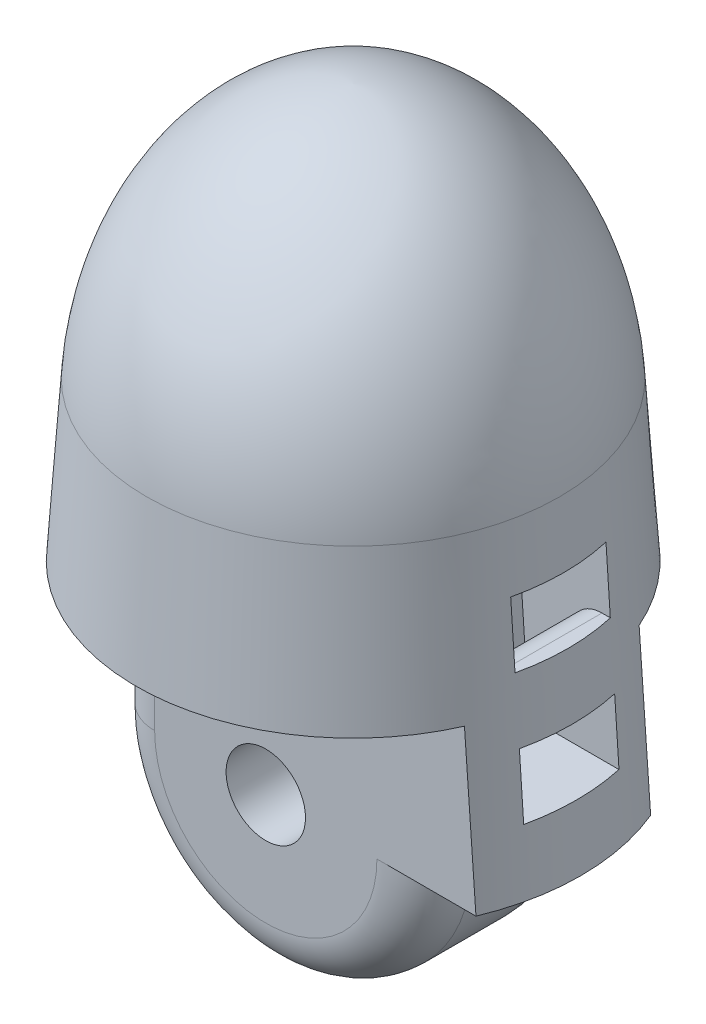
ISO-10303-21;
HEADER;
FILE_DESCRIPTION(('STEP AP214'),'2;1');
FILE_NAME('part.step','',(''),(''),'','','');
FILE_SCHEMA(('AUTOMOTIVE_DESIGN { 1 0 10303 214 1 1 1 1 }'));
ENDSEC;
DATA;
#1=APPLICATION_CONTEXT('core data for automotive mechanical design processes');
#2=APPLICATION_PROTOCOL_DEFINITION('international standard','automotive_design',2000,#1);
#3=PRODUCT_CONTEXT('',#1,'mechanical');
#4=PRODUCT('Part','Part','',(#3));
#5=PRODUCT_RELATED_PRODUCT_CATEGORY('part','',(#4));
#6=PRODUCT_DEFINITION_FORMATION('','',#4);
#7=PRODUCT_DEFINITION_CONTEXT('part definition',#1,'design');
#8=PRODUCT_DEFINITION('design','',#6,#7);
#9=PRODUCT_DEFINITION_SHAPE('','',#8);
#10=(LENGTH_UNIT() NAMED_UNIT(*) SI_UNIT(.MILLI.,.METRE.));
#11=(NAMED_UNIT(*) PLANE_ANGLE_UNIT() SI_UNIT($,.RADIAN.));
#12=(NAMED_UNIT(*) SI_UNIT($,.STERADIAN.) SOLID_ANGLE_UNIT());
#13=UNCERTAINTY_MEASURE_WITH_UNIT(LENGTH_MEASURE(1.E-05),#10,'distance_accuracy_value','');
#14=(GEOMETRIC_REPRESENTATION_CONTEXT(3) GLOBAL_UNCERTAINTY_ASSIGNED_CONTEXT((#13)) GLOBAL_UNIT_ASSIGNED_CONTEXT((#10,
#11,#12)) REPRESENTATION_CONTEXT('',''));
#15=CARTESIAN_POINT('',(0.,0.,0.));
#16=DIRECTION('',(0.,0.,1.));
#17=DIRECTION('',(1.,0.,0.));
#18=AXIS2_PLACEMENT_3D('',#15,#16,#17);
#19=CARTESIAN_POINT('',(0.,14.5666666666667,0.));
#20=DIRECTION('',(0.,0.,1.));
#21=DIRECTION('',(-0.0665190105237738,0.997785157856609,0.));
#22=AXIS2_PLACEMENT_3D('',#19,#20,#21);
#23=ELLIPSE('',#22,8.4520532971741,6.51442843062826);
#24=TRIMMED_CURVE('',#23,(PARAMETER_VALUE(3.05531167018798)),
(PARAMETER_VALUE(6.19690432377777)),.T.,.PARAMETER.);
#25=CARTESIAN_POINT('',(0.,0.,0.));
#26=DIRECTION('',(0.,-1.,0.));
#27=AXIS1_PLACEMENT('',#25,#26);
#28=SURFACE_OF_REVOLUTION('',#24,#27);
#29=CARTESIAN_POINT('',(0.,15.,0.));
#30=DIRECTION('',(0.,-1.,0.));
#31=DIRECTION('',(0.,0.,-1.));
#32=AXIS2_PLACEMENT_3D('',#29,#30,#31);
#33=CIRCLE('',#32,6.5);
#34=CARTESIAN_POINT('',(0.,15.,-6.5));
#35=VERTEX_POINT('',#34);
#36=EDGE_CURVE('E381',#35,#35,#33,.T.);
#37=ORIENTED_EDGE('',*,*,#36,.F.);
#38=EDGE_LOOP('',(#37));
#39=FACE_BOUND('',#38,.T.);
#40=CARTESIAN_POINT('',(0.,23.0059709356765,0.));
#41=VERTEX_POINT('',#40);
#42=VERTEX_LOOP('',#41);
#43=FACE_BOUND('',#42,.T.);
#44=CARTESIAN_POINT('',(-5.8,18.1335961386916,-0.399999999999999));
#45=CARTESIAN_POINT('',(-5.78266738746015,18.1782985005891,-0.399998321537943));
#46=CARTESIAN_POINT('',(-5.76508178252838,18.222900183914,-0.398877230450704));
#47=CARTESIAN_POINT('',(-5.7294619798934,18.3117874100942,-0.394141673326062));
#48=CARTESIAN_POINT('',(-5.7114278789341,18.3560730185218,-0.390527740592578));
#49=CARTESIAN_POINT('',(-5.67499263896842,18.4441682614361,-0.380435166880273));
#50=CARTESIAN_POINT('',(-5.65659155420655,18.4879779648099,-0.373956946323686));
#51=CARTESIAN_POINT('',(-5.6195704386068,18.574828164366,-0.357568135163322));
#52=CARTESIAN_POINT('',(-5.60095058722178,18.6178692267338,-0.347660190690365));
#53=CARTESIAN_POINT('',(-5.56362035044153,18.7029661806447,-0.323459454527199));
#54=CARTESIAN_POINT('',(-5.54490991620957,18.7450171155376,-0.309148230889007));
#55=CARTESIAN_POINT('',(-5.51728485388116,18.8063088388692,-0.283246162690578));
#56=CARTESIAN_POINT('',(-5.50817016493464,18.826398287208,-0.273899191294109));
#57=CARTESIAN_POINT('',(-5.49020702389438,18.8657505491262,-0.253405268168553));
#58=CARTESIAN_POINT('',(-5.48135851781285,18.8850135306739,-0.242258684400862));
#59=CARTESIAN_POINT('',(-5.46101671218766,18.9290437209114,-0.213329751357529));
#60=CARTESIAN_POINT('',(-5.44970578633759,18.9533235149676,-0.194598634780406));
#61=CARTESIAN_POINT('',(-5.43416062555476,18.9864834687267,-0.16218788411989));
#62=CARTESIAN_POINT('',(-5.42919357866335,18.9970400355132,-0.150593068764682));
#63=CARTESIAN_POINT('',(-5.42004926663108,19.0164216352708,-0.125746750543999));
#64=CARTESIAN_POINT('',(-5.41587013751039,19.0252507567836,-0.112499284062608));
#65=CARTESIAN_POINT('',(-5.40992440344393,19.0377873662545,-0.0890702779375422));
#66=CARTESIAN_POINT('',(-5.40781972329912,19.0422174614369,-0.0793647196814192));
#67=CARTESIAN_POINT('',(-5.40429085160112,19.0496384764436,-0.0593084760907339));
#68=CARTESIAN_POINT('',(-5.40286528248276,19.0526323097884,-0.0489591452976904));
#69=CARTESIAN_POINT('',(-5.40081905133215,19.0569278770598,-0.0277309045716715));
#70=CARTESIAN_POINT('',(-5.40020562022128,19.058214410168,-0.0168481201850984));
#71=CARTESIAN_POINT('',(-5.39988226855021,19.0588927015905,0.00499002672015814));
#72=CARTESIAN_POINT('',(-5.40017211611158,19.0582849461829,0.0159453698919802));
#73=CARTESIAN_POINT('',(-5.40154254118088,19.0554091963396,0.0364156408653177));
#74=CARTESIAN_POINT('',(-5.40253838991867,19.0533190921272,0.0459625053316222));
#75=CARTESIAN_POINT('',(-5.40513915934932,19.0478549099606,0.0646048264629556));
#76=CARTESIAN_POINT('',(-5.40674524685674,19.0444783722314,0.0736993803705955));
#77=CARTESIAN_POINT('',(-5.41138370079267,19.0347134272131,0.0957052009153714));
#78=CARTESIAN_POINT('',(-5.41472782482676,19.0276629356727,0.108255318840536));
#79=CARTESIAN_POINT('',(-5.42219424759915,19.0118790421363,0.131978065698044));
#80=CARTESIAN_POINT('',(-5.42631821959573,19.0031420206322,0.143147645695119));
#81=CARTESIAN_POINT('',(-5.43824244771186,18.9778014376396,0.171809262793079));
#82=CARTESIAN_POINT('',(-5.44655337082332,18.9600598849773,0.188070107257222));
#83=CARTESIAN_POINT('',(-5.46396741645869,18.9226571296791,0.217661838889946));
#84=CARTESIAN_POINT('',(-5.47307266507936,18.9029907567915,0.230984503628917));
#85=CARTESIAN_POINT('',(-5.49217206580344,18.861468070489,0.255930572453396));
#86=CARTESIAN_POINT('',(-5.50218789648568,18.8395513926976,0.267435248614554));
#87=CARTESIAN_POINT('',(-5.52246058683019,18.7948701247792,0.288416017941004));
#88=CARTESIAN_POINT('',(-5.53271765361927,18.7721047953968,0.297890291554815));
#89=CARTESIAN_POINT('',(-5.56366494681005,18.7028989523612,0.323846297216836));
#90=CARTESIAN_POINT('',(-5.5845093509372,18.6555960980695,0.337835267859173));
#91=CARTESIAN_POINT('',(-5.62896752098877,18.5530681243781,0.362600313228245));
#92=CARTESIAN_POINT('',(-5.65255702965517,18.497666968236,0.372644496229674));
#93=CARTESIAN_POINT('',(-5.6992197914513,18.3859321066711,0.387871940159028));
#94=CARTESIAN_POINT('',(-5.72229237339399,18.3295973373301,0.393049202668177));
#95=CARTESIAN_POINT('',(-5.76779026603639,18.2162152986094,0.399363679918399));
#96=CARTESIAN_POINT('',(-5.79021286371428,18.1591661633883,0.400485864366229));
#97=CARTESIAN_POINT('',(-5.83419151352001,18.0448349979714,0.399141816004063));
#98=CARTESIAN_POINT('',(-5.85574821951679,17.9875531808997,0.39667834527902));
#99=CARTESIAN_POINT('',(-5.90107833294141,17.8643433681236,0.387806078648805));
#100=CARTESIAN_POINT('',(-5.92470323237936,17.7983992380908,0.380863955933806));
#101=CARTESIAN_POINT('',(-5.97066575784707,17.666533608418,0.362612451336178));
#102=CARTESIAN_POINT('',(-5.99300127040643,17.6006123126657,0.351296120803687));
#103=CARTESIAN_POINT('',(-6.02540017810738,17.5021808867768,0.330691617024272));
#104=CARTESIAN_POINT('',(-6.03601004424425,17.4694639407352,0.323223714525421));
#105=CARTESIAN_POINT('',(-6.05684515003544,17.404248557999,0.306930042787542));
#106=CARTESIAN_POINT('',(-6.06707046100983,17.3717500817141,0.29810452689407));
#107=CARTESIAN_POINT('',(-6.08708110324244,17.3071722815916,0.278884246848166));
#108=CARTESIAN_POINT('',(-6.09686742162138,17.2750921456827,0.268493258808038));
#109=CARTESIAN_POINT('',(-6.11596679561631,17.2115039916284,0.245738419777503));
#110=CARTESIAN_POINT('',(-6.12528022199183,17.1799955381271,0.233376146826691));
#111=CARTESIAN_POINT('',(-6.13877196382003,17.1336376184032,0.212835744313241));
#112=CARTESIAN_POINT('',(-6.14317241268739,17.1183963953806,0.205689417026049));
#113=CARTESIAN_POINT('',(-6.15180359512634,17.0882703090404,0.190553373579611));
#114=CARTESIAN_POINT('',(-6.15603422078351,17.0733856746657,0.18256313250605));
#115=CARTESIAN_POINT('',(-6.1642399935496,17.0442958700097,0.165582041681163));
#116=CARTESIAN_POINT('',(-6.16821698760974,17.0300860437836,0.156600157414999));
#117=CARTESIAN_POINT('',(-6.17586846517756,17.0025491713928,0.137231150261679));
#118=CARTESIAN_POINT('',(-6.17954316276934,16.9892215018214,0.126845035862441));
#119=CARTESIAN_POINT('',(-6.18506030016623,16.9690814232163,0.108536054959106));
#120=CARTESIAN_POINT('',(-6.18705773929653,16.961757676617,0.101235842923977));
#121=CARTESIAN_POINT('',(-6.19078197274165,16.9480538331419,0.0857544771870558));
#122=CARTESIAN_POINT('',(-6.19250909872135,16.9416725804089,0.0775744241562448));
#123=CARTESIAN_POINT('',(-6.19612538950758,16.9282733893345,0.0568308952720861));
#124=CARTESIAN_POINT('',(-6.19783897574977,16.921890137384,0.0437640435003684));
#125=CARTESIAN_POINT('',(-6.19931017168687,16.9164027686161,0.0241885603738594));
#126=CARTESIAN_POINT('',(-6.19962566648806,16.9152245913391,0.0183018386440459));
#127=CARTESIAN_POINT('',(-6.19999268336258,16.913853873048,0.00640635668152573));
#128=CARTESIAN_POINT('',(-6.20004441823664,16.9136605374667,0.000397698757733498));
#129=CARTESIAN_POINT('',(-6.19987775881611,16.9142830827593,-0.0115561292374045));
#130=CARTESIAN_POINT('',(-6.19965959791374,16.915098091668,-0.0175013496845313));
#131=CARTESIAN_POINT('',(-6.19897704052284,16.9176455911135,-0.0291839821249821));
#132=CARTESIAN_POINT('',(-6.19851213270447,16.9193799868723,-0.0349209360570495));
#133=CARTESIAN_POINT('',(-6.19632747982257,16.9275176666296,-0.056389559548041));
#134=CARTESIAN_POINT('',(-6.19387646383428,16.9366260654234,-0.0710001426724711));
#135=CARTESIAN_POINT('',(-6.18839129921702,16.9568676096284,-0.0965038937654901));
#136=CARTESIAN_POINT('',(-6.18541264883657,16.9678048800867,-0.107590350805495));
#137=CARTESIAN_POINT('',(-6.17904932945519,16.9910119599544,-0.128201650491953));
#138=CARTESIAN_POINT('',(-6.17566337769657,17.0032859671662,-0.137721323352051));
#139=CARTESIAN_POINT('',(-6.16647968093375,17.0363404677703,-0.161043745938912));
#140=CARTESIAN_POINT('',(-6.16047678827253,17.0577196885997,-0.173890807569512));
#141=CARTESIAN_POINT('',(-6.14804831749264,17.1014606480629,-0.197582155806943));
#142=CARTESIAN_POINT('',(-6.14162185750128,17.123824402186,-0.208422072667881));
#143=CARTESIAN_POINT('',(-6.12841825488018,17.1692319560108,-0.228666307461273));
#144=CARTESIAN_POINT('',(-6.12163948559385,17.1922786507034,-0.238062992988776));
#145=CARTESIAN_POINT('',(-6.10782201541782,17.2387060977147,-0.255676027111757));
#146=CARTESIAN_POINT('',(-6.10078358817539,17.262086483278,-0.263893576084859));
#147=CARTESIAN_POINT('',(-6.08309380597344,17.3201714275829,-0.283018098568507));
#148=CARTESIAN_POINT('',(-6.07230369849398,17.3550175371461,-0.293366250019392));
#149=CARTESIAN_POINT('',(-6.05026159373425,17.4250235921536,-0.312377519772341));
#150=CARTESIAN_POINT('',(-6.03900946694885,17.4601836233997,-0.321040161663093));
#151=CARTESIAN_POINT('',(-6.00457589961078,17.5660478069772,-0.34486664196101));
#152=CARTESIAN_POINT('',(-5.9807461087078,17.6370412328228,-0.357839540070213));
#153=CARTESIAN_POINT('',(-5.93158432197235,17.7790614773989,-0.378672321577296));
#154=CARTESIAN_POINT('',(-5.9062555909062,17.8500879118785,-0.386542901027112));
#155=CARTESIAN_POINT('',(-5.85416208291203,17.9920254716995,-0.397208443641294));
#156=CARTESIAN_POINT('',(-5.82739709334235,18.0629365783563,-0.400002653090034));
#157=CARTESIAN_POINT('',(-5.8,18.1335961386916,-0.399999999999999));
#158=B_SPLINE_CURVE_WITH_KNOTS('',3,(#44,#45,#46,#47,#48,#49,#50,#51,#52,#53,#54,#55,#56,#57,
#58,#59,#60,#61,#62,#63,#64,#65,#66,#67,#68,#69,#70,#71,#72,#73,#74,#75,#76,#77,#78,#79,#80,#81,
#82,#83,#84,#85,#86,#87,#88,#89,#90,#91,#92,#93,#94,#95,#96,#97,#98,#99,#100,#101,#102,#103,
#104,#105,#106,#107,#108,#109,#110,#111,#112,#113,#114,#115,#116,#117,#118,#119,#120,#121,#122,
#123,#124,#125,#126,#127,#128,#129,#130,#131,#132,#133,#134,#135,#136,#137,#138,#139,#140,#141,
#142,#143,#144,#145,#146,#147,#148,#149,#150,#151,#152,#153,#154,#155,#156,#157),.UNSPECIFIED.,
.T.,.F.,(4,2,2,2,2,2,2,2,2,2,2,2,2,2,2,2,2,2,2,2,2,2,2,2,2,2,2,2,2,2,2,2,2,2,2,2,2,2,2,2,2,2,2,
2,2,2,2,2,2,2,2,2,2,2,2,2,4),(0.,0.143813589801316,0.287596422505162,0.431358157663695,
0.575009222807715,0.719269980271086,0.79107447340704,0.862864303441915,0.960260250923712,
1.0094761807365,1.05857417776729,1.0910868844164,1.12353335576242,1.15626681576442,
1.18899187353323,1.21833822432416,1.24774097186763,1.29182203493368,1.33599877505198,
1.41195129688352,1.48811374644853,1.56809582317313,1.64814927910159,1.80842983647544,
1.99132693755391,2.17444916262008,2.35824944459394,2.54190821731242,2.75294157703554,
2.96431156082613,3.06987678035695,3.17542232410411,3.28071723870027,3.38592828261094,
3.43810793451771,3.49032023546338,3.54209411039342,3.59383099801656,3.62535756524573,
3.65684514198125,3.69995739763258,3.71791498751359,3.73585808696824,3.753785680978,
3.77175057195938,3.82291302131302,3.87034778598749,3.91793605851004,3.9947217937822,
4.0716727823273,4.14901765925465,4.22628323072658,4.33997988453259,4.4537086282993,
4.68147534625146,4.90876303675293,5.13608447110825),.UNSPECIFIED.);
#159=CARTESIAN_POINT('',(-5.8,18.1335961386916,-0.399999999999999));
#160=VERTEX_POINT('',#159);
#161=EDGE_CURVE('E284',#160,#160,#158,.T.);
#162=ORIENTED_EDGE('',*,*,#161,.T.);
#163=EDGE_LOOP('',(#162));
#164=FACE_BOUND('',#163,.T.);
#165=ADVANCED_FACE('F153',(#39,#43,#164),#28,.F.);
#166=CARTESIAN_POINT('',(0.,0.,0.));
#167=DIRECTION('',(0.,-1.,0.));
#168=DIRECTION('',(0.,0.,-1.));
#169=AXIS2_PLACEMENT_3D('',#166,#167,#168);
#170=CONICAL_SURFACE('',#169,7.5,0.0665681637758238);
#171=CARTESIAN_POINT('',(5.98856100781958,19.8965758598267,1.5));
#172=CARTESIAN_POINT('',(6.12085283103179,17.9716111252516,1.5));
#173=CARTESIAN_POINT('',(6.2528943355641,16.046629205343,1.5));
#174=CARTESIAN_POINT('',(6.51655055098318,12.1966361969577,1.5));
#175=CARTESIAN_POINT('',(6.64816526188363,10.271625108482,1.5));
#176=CARTESIAN_POINT('',(6.87340841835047,6.97275039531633,1.5));
#177=CARTESIAN_POINT('',(6.96712345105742,5.59889268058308,1.5));
#178=CARTESIAN_POINT('',(7.15439314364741,2.85116628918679,1.5));
#179=CARTESIAN_POINT('',(7.2479478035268,1.47729761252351,1.5));
#180=CARTESIAN_POINT('',(7.34143197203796,0.103424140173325,1.5));
#181=B_SPLINE_CURVE_WITH_KNOTS('',3,(#171,#172,#173,#174,#175,#176,#177,#178,#179,#180),
.UNSPECIFIED.,.F.,.F.,(4,2,2,2,4),(0.,5.78851558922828,11.5770309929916,15.708181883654,
19.839332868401),.UNSPECIFIED.);
#182=CARTESIAN_POINT('',(6.46150997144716,13.,1.5));
#183=VERTEX_POINT('',#182);
#184=CARTESIAN_POINT('',(6.59831628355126,11.,1.5));
#185=VERTEX_POINT('',#184);
#186=EDGE_CURVE('E425',#183,#185,#181,.T.);
#187=ORIENTED_EDGE('',*,*,#186,.F.);
#188=CARTESIAN_POINT('',(0.,13.,0.));
#189=DIRECTION('',(0.,-1.,0.));
#190=DIRECTION('',(1.,0.,0.));
#191=AXIS2_PLACEMENT_3D('',#188,#189,#190);
#192=CIRCLE('',#191,6.63333333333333);
#193=CARTESIAN_POINT('',(6.46150997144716,13.,-1.5));
#194=VERTEX_POINT('',#193);
#195=EDGE_CURVE('E429',#183,#194,#192,.F.);
#196=ORIENTED_EDGE('',*,*,#195,.T.);
#197=CARTESIAN_POINT('',(5.98856100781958,19.8965758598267,-1.5));
#198=CARTESIAN_POINT('',(6.12085283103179,17.9716111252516,-1.5));
#199=CARTESIAN_POINT('',(6.2528943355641,16.046629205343,-1.5));
#200=CARTESIAN_POINT('',(6.51655055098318,12.1966361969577,-1.5));
#201=CARTESIAN_POINT('',(6.64816526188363,10.271625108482,-1.5));
#202=CARTESIAN_POINT('',(6.87340841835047,6.97275039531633,-1.5));
#203=CARTESIAN_POINT('',(6.96712345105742,5.59889268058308,-1.5));
#204=CARTESIAN_POINT('',(7.15439314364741,2.85116628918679,-1.5));
#205=CARTESIAN_POINT('',(7.2479478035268,1.47729761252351,-1.5));
#206=CARTESIAN_POINT('',(7.34143197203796,0.103424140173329,-1.5));
#207=B_SPLINE_CURVE_WITH_KNOTS('',3,(#197,#198,#199,#200,#201,#202,#203,#204,#205,#206),
.UNSPECIFIED.,.F.,.F.,(4,2,2,2,4),(0.,5.78851558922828,11.5770309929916,15.708181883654,
19.839332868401),.UNSPECIFIED.);
#208=CARTESIAN_POINT('',(6.59831628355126,11.,-1.5));
#209=VERTEX_POINT('',#208);
#210=EDGE_CURVE('E281',#194,#209,#207,.T.);
#211=ORIENTED_EDGE('',*,*,#210,.T.);
#212=CARTESIAN_POINT('',(0.,11.,0.));
#213=DIRECTION('',(0.,-1.,0.));
#214=DIRECTION('',(1.,0.,0.));
#215=AXIS2_PLACEMENT_3D('',#212,#213,#214);
#216=CIRCLE('',#215,6.76666666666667);
#217=EDGE_CURVE('E426',#185,#209,#216,.F.);
#218=ORIENTED_EDGE('',*,*,#217,.F.);
#219=EDGE_LOOP('',(#187,#196,#211,#218));
#220=FACE_BOUND('',#219,.T.);
#221=ORIENTED_EDGE('',*,*,#36,.T.);
#222=EDGE_LOOP('',(#221));
#223=FACE_BOUND('',#222,.T.);
#224=CARTESIAN_POINT('',(0.,10.,0.));
#225=DIRECTION('',(0.,-1.,0.));
#226=DIRECTION('',(0.,0.,-1.));
#227=AXIS2_PLACEMENT_3D('',#224,#225,#226);
#228=CIRCLE('',#227,6.83333333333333);
#229=CARTESIAN_POINT('',(6.2555530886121,10.,-2.75));
#230=VERTEX_POINT('',#229);
#231=CARTESIAN_POINT('',(6.2555530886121,10.,2.75));
#232=VERTEX_POINT('',#231);
#233=EDGE_CURVE('E384',#230,#232,#228,.F.);
#234=ORIENTED_EDGE('',*,*,#233,.T.);
#235=CARTESIAN_POINT('',(8.19804468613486,-17.2048505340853,2.75));
#236=CARTESIAN_POINT('',(8.00845466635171,-14.5089482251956,2.75));
#237=CARTESIAN_POINT('',(7.81824230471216,-11.8130894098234,2.75));
#238=CARTESIAN_POINT('',(7.43616495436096,-6.42149218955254,2.75));
#239=CARTESIAN_POINT('',(7.2442999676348,-3.72575378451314,2.75));
#240=CARTESIAN_POINT('',(6.88301247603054,1.32314550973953,2.75));
#241=CARTESIAN_POINT('',(6.71383515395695,3.67632392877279,2.75));
#242=CARTESIAN_POINT('',(6.37350874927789,8.38253784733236,2.75));
#243=CARTESIAN_POINT('',(6.20235966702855,10.7355733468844,2.75));
#244=CARTESIAN_POINT('',(5.85755001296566,15.4414656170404,2.75));
#245=CARTESIAN_POINT('',(5.68388943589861,17.7943223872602,2.75));
#246=CARTESIAN_POINT('',(5.42092621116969,21.3234241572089,2.75));
#247=CARTESIAN_POINT('',(5.33285971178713,22.4997612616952,2.75));
#248=CARTESIAN_POINT('',(5.15576221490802,24.8523630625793,2.75));
#249=CARTESIAN_POINT('',(5.06673121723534,26.0286277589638,2.75));
#250=CARTESIAN_POINT('',(4.97714778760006,27.2048505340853,2.75));
#251=B_SPLINE_CURVE_WITH_KNOTS('',3,(#235,#236,#237,#238,#239,#240,#241,#242,#243,#244,#245,
#246,#247,#248,#249,#250),.UNSPECIFIED.,.F.,.F.,(4,2,2,2,2,2,2,4),(0.,8.10768205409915,
16.2153543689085,23.2931094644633,30.3708632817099,37.4486319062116,40.9875186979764,
44.5264061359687),.UNSPECIFIED.);
#252=CARTESIAN_POINT('',(6.61805191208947,5.,2.75));
#253=VERTEX_POINT('',#252);
#254=EDGE_CURVE('E506',#253,#232,#251,.T.);
#255=ORIENTED_EDGE('',*,*,#254,.F.);
#256=CARTESIAN_POINT('',(0.,5.,0.));
#257=DIRECTION('',(0.,-1.,0.));
#258=DIRECTION('',(0.,0.,-1.));
#259=AXIS2_PLACEMENT_3D('',#256,#257,#258);
#260=CIRCLE('',#259,7.16666666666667);
#261=CARTESIAN_POINT('',(6.61805191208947,5.,-2.75));
#262=VERTEX_POINT('',#261);
#263=EDGE_CURVE('E388',#253,#262,#260,.F.);
#264=ORIENTED_EDGE('',*,*,#263,.T.);
#265=CARTESIAN_POINT('',(8.19804468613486,-17.2048505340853,-2.75));
#266=CARTESIAN_POINT('',(8.00845466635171,-14.5089482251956,-2.75));
#267=CARTESIAN_POINT('',(7.81824230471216,-11.8130894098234,-2.75));
#268=CARTESIAN_POINT('',(7.43616495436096,-6.42149218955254,-2.75));
#269=CARTESIAN_POINT('',(7.2442999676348,-3.72575378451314,-2.75));
#270=CARTESIAN_POINT('',(6.88301247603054,1.32314550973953,-2.75));
#271=CARTESIAN_POINT('',(6.71383515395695,3.67632392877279,-2.75));
#272=CARTESIAN_POINT('',(6.37350874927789,8.38253784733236,-2.75));
#273=CARTESIAN_POINT('',(6.20235966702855,10.7355733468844,-2.75));
#274=CARTESIAN_POINT('',(5.85755001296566,15.4414656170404,-2.75));
#275=CARTESIAN_POINT('',(5.68388943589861,17.7943223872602,-2.75));
#276=CARTESIAN_POINT('',(5.42092621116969,21.3234241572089,-2.75));
#277=CARTESIAN_POINT('',(5.33285971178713,22.4997612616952,-2.75));
#278=CARTESIAN_POINT('',(5.15576221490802,24.8523630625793,-2.75));
#279=CARTESIAN_POINT('',(5.06673121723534,26.0286277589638,-2.75));
#280=CARTESIAN_POINT('',(4.97714778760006,27.2048505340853,-2.75));
#281=B_SPLINE_CURVE_WITH_KNOTS('',3,(#265,#266,#267,#268,#269,#270,#271,#272,#273,#274,#275,
#276,#277,#278,#279,#280),.UNSPECIFIED.,.F.,.F.,(4,2,2,2,2,2,2,4),(0.,8.10768205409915,
16.2153543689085,23.2931094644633,30.3708632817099,37.4486319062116,40.9875186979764,
44.5264061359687),.UNSPECIFIED.);
#282=EDGE_CURVE('E328',#262,#230,#281,.T.);
#283=ORIENTED_EDGE('',*,*,#282,.T.);
#284=EDGE_LOOP('',(#234,#255,#264,#283));
#285=FACE_BOUND('',#284,.T.);
#286=CARTESIAN_POINT('',(6.73498329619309,9.,1.5));
#287=VERTEX_POINT('',#286);
#288=CARTESIAN_POINT('',(6.87151932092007,7.,1.5));
#289=VERTEX_POINT('',#288);
#290=EDGE_CURVE('E418',#287,#289,#181,.T.);
#291=ORIENTED_EDGE('',*,*,#290,.F.);
#292=CARTESIAN_POINT('',(0.,9.00000000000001,0.));
#293=DIRECTION('',(0.,-1.,0.));
#294=DIRECTION('',(1.,0.,0.));
#295=AXIS2_PLACEMENT_3D('',#292,#293,#294);
#296=CIRCLE('',#295,6.9);
#297=CARTESIAN_POINT('',(6.73498329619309,9.,-1.5));
#298=VERTEX_POINT('',#297);
#299=EDGE_CURVE('E403',#287,#298,#296,.F.);
#300=ORIENTED_EDGE('',*,*,#299,.T.);
#301=CARTESIAN_POINT('',(6.87151932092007,7.,-1.5));
#302=VERTEX_POINT('',#301);
#303=EDGE_CURVE('E391',#298,#302,#207,.T.);
#304=ORIENTED_EDGE('',*,*,#303,.T.);
#305=CARTESIAN_POINT('',(0.,7.,0.));
#306=DIRECTION('',(0.,-1.,0.));
#307=DIRECTION('',(1.,0.,0.));
#308=AXIS2_PLACEMENT_3D('',#305,#306,#307);
#309=CIRCLE('',#308,7.03333333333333);
#310=EDGE_CURVE('E424',#289,#302,#309,.F.);
#311=ORIENTED_EDGE('',*,*,#310,.F.);
#312=EDGE_LOOP('',(#291,#300,#304,#311));
#313=FACE_BOUND('',#312,.T.);
#314=ADVANCED_FACE('F340',(#220,#223,#285,#313),#170,.T.);
#315=CARTESIAN_POINT('',(0.,5.,-7.5));
#316=DIRECTION('',(0.,0.,1.));
#317=DIRECTION('',(1.,0.,0.));
#318=AXIS2_PLACEMENT_3D('',#315,#316,#317);
#319=CYLINDRICAL_SURFACE('',#318,5.);
#320=DIRECTION('',(0.,0.,1.));
#321=VECTOR('',#320,1.);
#322=CARTESIAN_POINT('',(5.,5.,-7.5));
#323=LINE('',#322,#321);
#324=CARTESIAN_POINT('',(5.,5.,-1.25));
#325=VERTEX_POINT('',#324);
#326=CARTESIAN_POINT('',(5.,5.,1.25));
#327=VERTEX_POINT('',#326);
#328=EDGE_CURVE('E514',#325,#327,#323,.T.);
#329=ORIENTED_EDGE('',*,*,#328,.T.);
#330=CARTESIAN_POINT('',(0.,5.,1.25));
#331=DIRECTION('',(0.,0.,-1.));
#332=DIRECTION('',(-1.,0.,0.));
#333=AXIS2_PLACEMENT_3D('',#330,#331,#332);
#334=CIRCLE('',#333,5.);
#335=CARTESIAN_POINT('',(-5.,5.,1.25));
#336=VERTEX_POINT('',#335);
#337=EDGE_CURVE('E452',#327,#336,#334,.T.);
#338=ORIENTED_EDGE('',*,*,#337,.T.);
#339=DIRECTION('',(0.,0.,1.));
#340=VECTOR('',#339,1.);
#341=CARTESIAN_POINT('',(-5.,5.,-7.5));
#342=LINE('',#341,#340);
#343=CARTESIAN_POINT('',(-5.,5.,-1.25));
#344=VERTEX_POINT('',#343);
#345=EDGE_CURVE('E379',#344,#336,#342,.T.);
#346=ORIENTED_EDGE('',*,*,#345,.F.);
#347=CARTESIAN_POINT('',(0.,5.,-1.25));
#348=DIRECTION('',(0.,0.,-1.));
#349=DIRECTION('',(-1.,0.,0.));
#350=AXIS2_PLACEMENT_3D('',#347,#348,#349);
#351=CIRCLE('',#350,5.);
#352=EDGE_CURVE('E450',#344,#325,#351,.F.);
#353=ORIENTED_EDGE('',*,*,#352,.T.);
#354=EDGE_LOOP('',(#329,#338,#346,#353));
#355=FACE_BOUND('',#354,.T.);
#356=ADVANCED_FACE('F368',(#355),#319,.T.);
#357=CARTESIAN_POINT('',(-5.,0.,-7.5));
#358=DIRECTION('',(-1.,0.,0.));
#359=DIRECTION('',(0.,0.,1.));
#360=AXIS2_PLACEMENT_3D('',#357,#358,#359);
#361=PLANE('',#360);
#362=ORIENTED_EDGE('',*,*,#345,.T.);
#363=DIRECTION('',(0.,-1.,0.));
#364=VECTOR('',#363,1.);
#365=CARTESIAN_POINT('',(-5.,10.,1.25));
#366=LINE('',#365,#364);
#367=CARTESIAN_POINT('',(-5.,10.,1.25));
#368=VERTEX_POINT('',#367);
#369=EDGE_CURVE('E444',#336,#368,#366,.F.);
#370=ORIENTED_EDGE('',*,*,#369,.T.);
#371=DIRECTION('',(0.,0.,1.));
#372=VECTOR('',#371,1.);
#373=CARTESIAN_POINT('',(-5.,10.,-7.5));
#374=LINE('',#373,#372);
#375=CARTESIAN_POINT('',(-5.,10.,-1.25));
#376=VERTEX_POINT('',#375);
#377=EDGE_CURVE('E385',#376,#368,#374,.T.);
#378=ORIENTED_EDGE('',*,*,#377,.F.);
#379=DIRECTION('',(0.,-1.,0.));
#380=VECTOR('',#379,1.);
#381=CARTESIAN_POINT('',(-5.,0.,-1.25));
#382=LINE('',#381,#380);
#383=EDGE_CURVE('E441',#376,#344,#382,.T.);
#384=ORIENTED_EDGE('',*,*,#383,.T.);
#385=EDGE_LOOP('',(#362,#370,#378,#384));
#386=FACE_BOUND('',#385,.T.);
#387=ADVANCED_FACE('F361',(#386),#361,.T.);
#388=CARTESIAN_POINT('',(0.,5.,-7.5));
#389=DIRECTION('',(0.,-1.,0.));
#390=DIRECTION('',(0.,0.,-1.));
#391=AXIS2_PLACEMENT_3D('',#388,#389,#390);
#392=PLANE('',#391);
#393=DIRECTION('',(1.,0.,0.));
#394=VECTOR('',#393,1.);
#395=CARTESIAN_POINT('',(0.,5.,2.75));
#396=LINE('',#395,#394);
#397=CARTESIAN_POINT('',(3.5,5.,2.75));
#398=VERTEX_POINT('',#397);
#399=EDGE_CURVE('E338',#398,#253,#396,.T.);
#400=ORIENTED_EDGE('',*,*,#399,.F.);
#401=CARTESIAN_POINT('',(3.5,5.,1.25));
#402=DIRECTION('',(0.,-1.,0.));
#403=DIRECTION('',(0.,0.,-1.));
#404=AXIS2_PLACEMENT_3D('',#401,#402,#403);
#405=CIRCLE('',#404,1.5);
#406=EDGE_CURVE('E458',#398,#327,#405,.F.);
#407=ORIENTED_EDGE('',*,*,#406,.T.);
#408=ORIENTED_EDGE('',*,*,#328,.F.);
#409=CARTESIAN_POINT('',(3.5,5.,-1.25));
#410=DIRECTION('',(0.,-1.,0.));
#411=DIRECTION('',(0.,0.,-1.));
#412=AXIS2_PLACEMENT_3D('',#409,#410,#411);
#413=CIRCLE('',#412,1.5);
#414=CARTESIAN_POINT('',(3.5,5.,-2.75));
#415=VERTEX_POINT('',#414);
#416=EDGE_CURVE('E460',#325,#415,#413,.F.);
#417=ORIENTED_EDGE('',*,*,#416,.T.);
#418=DIRECTION('',(1.,0.,0.));
#419=VECTOR('',#418,1.);
#420=CARTESIAN_POINT('',(0.,5.,-2.75));
#421=LINE('',#420,#419);
#422=EDGE_CURVE('E325',#415,#262,#421,.T.);
#423=ORIENTED_EDGE('',*,*,#422,.T.);
#424=ORIENTED_EDGE('',*,*,#263,.F.);
#425=EDGE_LOOP('',(#400,#407,#408,#417,#423,#424));
#426=FACE_BOUND('',#425,.T.);
#427=ADVANCED_FACE('F358',(#426),#392,.T.);
#428=CARTESIAN_POINT('',(0.,10.,-7.5));
#429=DIRECTION('',(0.,-1.,0.));
#430=DIRECTION('',(0.,0.,-1.));
#431=AXIS2_PLACEMENT_3D('',#428,#429,#430);
#432=PLANE('',#431);
#433=CARTESIAN_POINT('',(-5.8,10.,0.));
#434=DIRECTION('',(0.,-1.,0.));
#435=DIRECTION('',(0.,0.,-1.));
#436=AXIS2_PLACEMENT_3D('',#433,#434,#435);
#437=CIRCLE('',#436,0.4);
#438=CARTESIAN_POINT('',(-5.8,10.,-0.4));
#439=VERTEX_POINT('',#438);
#440=EDGE_CURVE('E431',#439,#439,#437,.F.);
#441=ORIENTED_EDGE('',*,*,#440,.T.);
#442=EDGE_LOOP('',(#441));
#443=FACE_BOUND('',#442,.T.);
#444=DIRECTION('',(1.,0.,0.));
#445=VECTOR('',#444,1.);
#446=CARTESIAN_POINT('',(-6.83333333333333,10.,-2.75));
#447=LINE('',#446,#445);
#448=CARTESIAN_POINT('',(-3.5,10.,-2.75));
#449=VERTEX_POINT('',#448);
#450=EDGE_CURVE('E294',#449,#230,#447,.T.);
#451=ORIENTED_EDGE('',*,*,#450,.F.);
#452=CARTESIAN_POINT('',(-3.5,10.,-1.25));
#453=DIRECTION('',(0.,-1.,0.));
#454=DIRECTION('',(0.,0.,-1.));
#455=AXIS2_PLACEMENT_3D('',#452,#453,#454);
#456=CIRCLE('',#455,1.5);
#457=EDGE_CURVE('E456',#449,#376,#456,.F.);
#458=ORIENTED_EDGE('',*,*,#457,.T.);
#459=ORIENTED_EDGE('',*,*,#377,.T.);
#460=CARTESIAN_POINT('',(-3.5,10.,1.25));
#461=DIRECTION('',(0.,-1.,0.));
#462=DIRECTION('',(0.,0.,-1.));
#463=AXIS2_PLACEMENT_3D('',#460,#461,#462);
#464=CIRCLE('',#463,1.5);
#465=CARTESIAN_POINT('',(-3.5,10.,2.75));
#466=VERTEX_POINT('',#465);
#467=EDGE_CURVE('E454',#368,#466,#464,.F.);
#468=ORIENTED_EDGE('',*,*,#467,.T.);
#469=DIRECTION('',(1.,0.,0.));
#470=VECTOR('',#469,1.);
#471=CARTESIAN_POINT('',(-6.83333333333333,10.,2.75));
#472=LINE('',#471,#470);
#473=EDGE_CURVE('E321',#466,#232,#472,.T.);
#474=ORIENTED_EDGE('',*,*,#473,.T.);
#475=ORIENTED_EDGE('',*,*,#233,.F.);
#476=EDGE_LOOP('',(#451,#458,#459,#468,#474,#475));
#477=FACE_BOUND('',#476,.T.);
#478=ADVANCED_FACE('F350',(#443,#477),#432,.T.);
#479=CARTESIAN_POINT('',(-6.83333333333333,0.,-2.75));
#480=DIRECTION('',(0.,0.,-1.));
#481=DIRECTION('',(-1.,0.,0.));
#482=AXIS2_PLACEMENT_3D('',#479,#480,#481);
#483=PLANE('',#482);
#484=CARTESIAN_POINT('',(0.,5.,-2.75));
#485=DIRECTION('',(0.,0.,-1.));
#486=DIRECTION('',(-1.,0.,0.));
#487=AXIS2_PLACEMENT_3D('',#484,#485,#486);
#488=CIRCLE('',#487,3.5);
#489=CARTESIAN_POINT('',(-3.5,5.,-2.75));
#490=VERTEX_POINT('',#489);
#491=EDGE_CURVE('E446',#415,#490,#488,.T.);
#492=ORIENTED_EDGE('',*,*,#491,.T.);
#493=DIRECTION('',(0.,-1.,0.));
#494=VECTOR('',#493,1.);
#495=CARTESIAN_POINT('',(-3.5,0.,-2.75));
#496=LINE('',#495,#494);
#497=EDGE_CURVE('E448',#490,#449,#496,.F.);
#498=ORIENTED_EDGE('',*,*,#497,.T.);
#499=ORIENTED_EDGE('',*,*,#450,.T.);
#500=ORIENTED_EDGE('',*,*,#282,.F.);
#501=ORIENTED_EDGE('',*,*,#422,.F.);
#502=EDGE_LOOP('',(#492,#498,#499,#500,#501));
#503=FACE_BOUND('',#502,.T.);
#504=CARTESIAN_POINT('',(0.,5.,-2.75));
#505=DIRECTION('',(0.,0.,-1.));
#506=DIRECTION('',(-1.,0.,0.));
#507=AXIS2_PLACEMENT_3D('',#504,#505,#506);
#508=CIRCLE('',#507,1.25);
#509=CARTESIAN_POINT('',(1.25,5.,-2.75));
#510=VERTEX_POINT('',#509);
#511=EDGE_CURVE('E323',#510,#510,#508,.F.);
#512=ORIENTED_EDGE('',*,*,#511,.T.);
#513=EDGE_LOOP('',(#512));
#514=FACE_BOUND('',#513,.T.);
#515=ADVANCED_FACE('F344',(#503,#514),#483,.T.);
#516=CARTESIAN_POINT('',(-6.83333333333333,0.,2.75));
#517=DIRECTION('',(0.,0.,-1.));
#518=DIRECTION('',(-1.,0.,0.));
#519=AXIS2_PLACEMENT_3D('',#516,#517,#518);
#520=PLANE('',#519);
#521=ORIENTED_EDGE('',*,*,#473,.F.);
#522=DIRECTION('',(0.,-1.,0.));
#523=VECTOR('',#522,1.);
#524=CARTESIAN_POINT('',(-3.5,5.,2.75));
#525=LINE('',#524,#523);
#526=CARTESIAN_POINT('',(-3.5,5.,2.75));
#527=VERTEX_POINT('',#526);
#528=EDGE_CURVE('E438',#466,#527,#525,.T.);
#529=ORIENTED_EDGE('',*,*,#528,.T.);
#530=CARTESIAN_POINT('',(0.,5.,2.75));
#531=DIRECTION('',(0.,0.,-1.));
#532=DIRECTION('',(-1.,0.,0.));
#533=AXIS2_PLACEMENT_3D('',#530,#531,#532);
#534=CIRCLE('',#533,3.5);
#535=EDGE_CURVE('E435',#527,#398,#534,.F.);
#536=ORIENTED_EDGE('',*,*,#535,.T.);
#537=ORIENTED_EDGE('',*,*,#399,.T.);
#538=ORIENTED_EDGE('',*,*,#254,.T.);
#539=EDGE_LOOP('',(#521,#529,#536,#537,#538));
#540=FACE_BOUND('',#539,.T.);
#541=CARTESIAN_POINT('',(0.,5.,2.75));
#542=DIRECTION('',(0.,0.,-1.));
#543=DIRECTION('',(-1.,0.,0.));
#544=AXIS2_PLACEMENT_3D('',#541,#542,#543);
#545=CIRCLE('',#544,1.25);
#546=CARTESIAN_POINT('',(1.25,5.,2.75));
#547=VERTEX_POINT('',#546);
#548=EDGE_CURVE('E337',#547,#547,#545,.F.);
#549=ORIENTED_EDGE('',*,*,#548,.F.);
#550=EDGE_LOOP('',(#549));
#551=FACE_BOUND('',#550,.T.);
#552=ADVANCED_FACE('F349',(#540,#551),#520,.F.);
#553=CARTESIAN_POINT('',(0.,5.,-7.5));
#554=DIRECTION('',(0.,0.,1.));
#555=DIRECTION('',(1.,0.,0.));
#556=AXIS2_PLACEMENT_3D('',#553,#554,#555);
#557=CYLINDRICAL_SURFACE('',#556,1.25);
#558=CARTESIAN_POINT('',(1.25,5.,2.75));
#559=CARTESIAN_POINT('',(1.25,5.,2.69270833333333));
#560=CARTESIAN_POINT('',(1.25,5.,2.63541666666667));
#561=CARTESIAN_POINT('',(1.25,5.,2.52083333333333));
#562=CARTESIAN_POINT('',(1.25,5.,2.46354166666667));
#563=CARTESIAN_POINT('',(1.25,5.,2.34895833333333));
#564=CARTESIAN_POINT('',(1.25,5.,2.29166666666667));
#565=CARTESIAN_POINT('',(1.25,5.,2.17708333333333));
#566=CARTESIAN_POINT('',(1.25,5.,2.11979166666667));
#567=CARTESIAN_POINT('',(1.25,5.,2.00520833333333));
#568=CARTESIAN_POINT('',(1.25,5.,1.94791666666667));
#569=CARTESIAN_POINT('',(1.25,5.,1.83333333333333));
#570=CARTESIAN_POINT('',(1.25,5.,1.77604166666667));
#571=CARTESIAN_POINT('',(1.25,5.,1.66145833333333));
#572=CARTESIAN_POINT('',(1.25,5.,1.60416666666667));
#573=CARTESIAN_POINT('',(1.25,5.,1.48958333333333));
#574=CARTESIAN_POINT('',(1.25,5.,1.43229166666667));
#575=CARTESIAN_POINT('',(1.25,5.,1.31770833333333));
#576=CARTESIAN_POINT('',(1.25,5.,1.26041666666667));
#577=CARTESIAN_POINT('',(1.25,5.,1.14583333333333));
#578=CARTESIAN_POINT('',(1.25,5.,1.08854166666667));
#579=CARTESIAN_POINT('',(1.25,5.,0.973958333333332));
#580=CARTESIAN_POINT('',(1.25,5.,0.916666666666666));
#581=CARTESIAN_POINT('',(1.25,5.,0.802083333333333));
#582=CARTESIAN_POINT('',(1.25,5.,0.744791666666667));
#583=CARTESIAN_POINT('',(1.25,5.,0.630208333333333));
#584=CARTESIAN_POINT('',(1.25,5.,0.572916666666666));
#585=CARTESIAN_POINT('',(1.25,5.,0.458333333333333));
#586=CARTESIAN_POINT('',(1.25,5.,0.401041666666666));
#587=CARTESIAN_POINT('',(1.25,5.,0.286458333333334));
#588=CARTESIAN_POINT('',(1.25,5.,0.229166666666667));
#589=CARTESIAN_POINT('',(1.25,5.,0.114583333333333));
#590=CARTESIAN_POINT('',(1.25,5.,0.0572916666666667));
#591=CARTESIAN_POINT('',(1.25,5.,-0.0572916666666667));
#592=CARTESIAN_POINT('',(1.25,5.,-0.114583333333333));
#593=CARTESIAN_POINT('',(1.25,5.,-0.229166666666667));
#594=CARTESIAN_POINT('',(1.25,5.,-0.286458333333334));
#595=CARTESIAN_POINT('',(1.25,5.,-0.401041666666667));
#596=CARTESIAN_POINT('',(1.25,5.,-0.458333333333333));
#597=CARTESIAN_POINT('',(1.25,5.,-0.572916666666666));
#598=CARTESIAN_POINT('',(1.25,5.,-0.630208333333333));
#599=CARTESIAN_POINT('',(1.25,5.,-0.744791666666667));
#600=CARTESIAN_POINT('',(1.25,5.,-0.802083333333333));
#601=CARTESIAN_POINT('',(1.25,5.,-0.916666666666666));
#602=CARTESIAN_POINT('',(1.25,5.,-0.973958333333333));
#603=CARTESIAN_POINT('',(1.25,5.,-1.08854166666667));
#604=CARTESIAN_POINT('',(1.25,5.,-1.14583333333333));
#605=CARTESIAN_POINT('',(1.25,5.,-1.26041666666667));
#606=CARTESIAN_POINT('',(1.25,5.,-1.31770833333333));
#607=CARTESIAN_POINT('',(1.25,5.,-1.43229166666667));
#608=CARTESIAN_POINT('',(1.25,5.,-1.48958333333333));
#609=CARTESIAN_POINT('',(1.25,5.,-1.60416666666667));
#610=CARTESIAN_POINT('',(1.25,5.,-1.66145833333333));
#611=CARTESIAN_POINT('',(1.25,5.,-1.77604166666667));
#612=CARTESIAN_POINT('',(1.25,5.,-1.83333333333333));
#613=CARTESIAN_POINT('',(1.25,5.,-1.94791666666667));
#614=CARTESIAN_POINT('',(1.25,5.,-2.00520833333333));
#615=CARTESIAN_POINT('',(1.25,5.,-2.11979166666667));
#616=CARTESIAN_POINT('',(1.25,5.,-2.17708333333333));
#617=CARTESIAN_POINT('',(1.25,5.,-2.29166666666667));
#618=CARTESIAN_POINT('',(1.25,5.,-2.34895833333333));
#619=CARTESIAN_POINT('',(1.25,5.,-2.46354166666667));
#620=CARTESIAN_POINT('',(1.25,5.,-2.52083333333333));
#621=CARTESIAN_POINT('',(1.25,5.,-2.63541666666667));
#622=CARTESIAN_POINT('',(1.25,5.,-2.69270833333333));
#623=CARTESIAN_POINT('',(1.25,5.,-2.75));
#624=B_SPLINE_CURVE_WITH_KNOTS('',3,(#558,#559,#560,#561,#562,#563,#564,#565,#566,#567,#568,
#569,#570,#571,#572,#573,#574,#575,#576,#577,#578,#579,#580,#581,#582,#583,#584,#585,#586,#587,
#588,#589,#590,#591,#592,#593,#594,#595,#596,#597,#598,#599,#600,#601,#602,#603,#604,#605,#606,
#607,#608,#609,#610,#611,#612,#613,#614,#615,#616,#617,#618,#619,#620,#621,#622,#623),
.UNSPECIFIED.,.F.,.F.,(4,2,2,2,2,2,2,2,2,2,2,2,2,2,2,2,2,2,2,2,2,2,2,2,2,2,2,2,2,2,2,2,4),(0.,
0.171875,0.34375,0.515625,0.687500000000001,0.859374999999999,1.03125,1.203125,1.375,1.546875,
1.71875,1.890625,2.0625,2.234375,2.40625,2.578125,2.75,2.921875,3.09375,3.265625,3.4375,
3.609375,3.78125,3.953125,4.125,4.296875,4.46875,4.640625,4.8125,4.984375,5.15625,5.328125,5.5),.UNSPECIFIED.);
#625=EDGE_CURVE('BSEAM354',#547,#510,#624,.T.);
#626=ORIENTED_EDGE('',*,*,#548,.T.);
#627=ORIENTED_EDGE('',*,*,#511,.F.);
#628=ORIENTED_EDGE('',*,*,#625,.T.);
#629=ORIENTED_EDGE('',*,*,#625,.F.);
#630=EDGE_LOOP('',(#626,#628,#627,#629));
#631=FACE_BOUND('',#630,.T.);
#632=ADVANCED_FACE('F354',(#631),#557,.F.);
#633=CARTESIAN_POINT('',(0.,13.,1.5));
#634=DIRECTION('',(0.,-1.,0.));
#635=DIRECTION('',(1.,0.,0.));
#636=AXIS2_PLACEMENT_3D('',#633,#634,#635);
#637=PLANE('',#636);
#638=ORIENTED_EDGE('',*,*,#195,.F.);
#639=DIRECTION('',(-1.,0.,0.));
#640=VECTOR('',#639,1.);
#641=CARTESIAN_POINT('',(0.,13.,1.5));
#642=LINE('',#641,#640);
#643=CARTESIAN_POINT('',(3.63333333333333,13.,1.5));
#644=VERTEX_POINT('',#643);
#645=EDGE_CURVE('E290',#183,#644,#642,.T.);
#646=ORIENTED_EDGE('',*,*,#645,.T.);
#647=DIRECTION('',(0.,0.,-1.));
#648=VECTOR('',#647,1.);
#649=CARTESIAN_POINT('',(3.63333333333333,13.,1.5));
#650=LINE('',#649,#648);
#651=CARTESIAN_POINT('',(3.63333333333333,13.,-1.5));
#652=VERTEX_POINT('',#651);
#653=EDGE_CURVE('E287',#644,#652,#650,.T.);
#654=ORIENTED_EDGE('',*,*,#653,.T.);
#655=DIRECTION('',(-1.,0.,0.));
#656=VECTOR('',#655,1.);
#657=CARTESIAN_POINT('',(0.,13.,-1.5));
#658=LINE('',#657,#656);
#659=EDGE_CURVE('E274',#194,#652,#658,.T.);
#660=ORIENTED_EDGE('',*,*,#659,.F.);
#661=EDGE_LOOP('',(#638,#646,#654,#660));
#662=FACE_BOUND('',#661,.T.);
#663=ADVANCED_FACE('F288',(#662),#637,.T.);
#664=CARTESIAN_POINT('',(4.48008849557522,0.298672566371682,1.5));
#665=DIRECTION('',(-0.997785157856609,-0.0665190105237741,0.));
#666=DIRECTION('',(0.0665190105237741,-0.997785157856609,0.));
#667=AXIS2_PLACEMENT_3D('',#664,#665,#666);
#668=PLANE('',#667);
#669=ORIENTED_EDGE('',*,*,#653,.F.);
#670=DIRECTION('',(-0.0665190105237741,0.997785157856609,0.));
#671=VECTOR('',#670,1.);
#672=CARTESIAN_POINT('',(4.48008849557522,0.298672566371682,1.5));
#673=LINE('',#672,#671);
#674=CARTESIAN_POINT('',(4.03333333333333,7.,1.5));
#675=VERTEX_POINT('',#674);
#676=EDGE_CURVE('E311',#675,#644,#673,.T.);
#677=ORIENTED_EDGE('',*,*,#676,.F.);
#678=DIRECTION('',(0.,0.,-1.));
#679=VECTOR('',#678,1.);
#680=CARTESIAN_POINT('',(4.03333333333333,7.,1.5));
#681=LINE('',#680,#679);
#682=CARTESIAN_POINT('',(4.03333333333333,7.,-1.5));
#683=VERTEX_POINT('',#682);
#684=EDGE_CURVE('E295',#675,#683,#681,.T.);
#685=ORIENTED_EDGE('',*,*,#684,.T.);
#686=DIRECTION('',(-0.0665190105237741,0.997785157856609,0.));
#687=VECTOR('',#686,1.);
#688=CARTESIAN_POINT('',(4.48008849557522,0.298672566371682,-1.5));
#689=LINE('',#688,#687);
#690=EDGE_CURVE('E279',#683,#652,#689,.T.);
#691=ORIENTED_EDGE('',*,*,#690,.T.);
#692=EDGE_LOOP('',(#669,#677,#685,#691));
#693=FACE_BOUND('',#692,.T.);
#694=ADVANCED_FACE('F298',(#693),#668,.F.);
#695=CARTESIAN_POINT('',(0.,7.,1.5));
#696=DIRECTION('',(0.,-1.,0.));
#697=DIRECTION('',(1.,0.,0.));
#698=AXIS2_PLACEMENT_3D('',#695,#696,#697);
#699=PLANE('',#698);
#700=ORIENTED_EDGE('',*,*,#310,.T.);
#701=DIRECTION('',(-1.,0.,0.));
#702=VECTOR('',#701,1.);
#703=CARTESIAN_POINT('',(0.,7.,-1.5));
#704=LINE('',#703,#702);
#705=EDGE_CURVE('E300',#302,#683,#704,.T.);
#706=ORIENTED_EDGE('',*,*,#705,.T.);
#707=ORIENTED_EDGE('',*,*,#684,.F.);
#708=DIRECTION('',(-1.,0.,0.));
#709=VECTOR('',#708,1.);
#710=CARTESIAN_POINT('',(0.,7.,1.5));
#711=LINE('',#710,#709);
#712=EDGE_CURVE('E313',#289,#675,#711,.T.);
#713=ORIENTED_EDGE('',*,*,#712,.F.);
#714=EDGE_LOOP('',(#700,#706,#707,#713));
#715=FACE_BOUND('',#714,.T.);
#716=ADVANCED_FACE('F494',(#715),#699,.F.);
#717=CARTESIAN_POINT('',(0.,9.00000000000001,1.5));
#718=DIRECTION('',(0.,-1.,0.));
#719=DIRECTION('',(1.,0.,0.));
#720=AXIS2_PLACEMENT_3D('',#717,#718,#719);
#721=PLANE('',#720);
#722=DIRECTION('',(-1.,0.,0.));
#723=VECTOR('',#722,1.);
#724=CARTESIAN_POINT('',(0.,9.00000000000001,1.5));
#725=LINE('',#724,#723);
#726=CARTESIAN_POINT('',(6.33555309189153,9.,1.5));
#727=VERTEX_POINT('',#726);
#728=EDGE_CURVE('E315',#287,#727,#725,.T.);
#729=ORIENTED_EDGE('',*,*,#728,.T.);
#730=DIRECTION('',(0.,0.,-1.));
#731=VECTOR('',#730,1.);
#732=CARTESIAN_POINT('',(6.33555309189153,9.,-1.5));
#733=LINE('',#732,#731);
#734=CARTESIAN_POINT('',(6.33555309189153,9.,-1.5));
#735=VERTEX_POINT('',#734);
#736=EDGE_CURVE('E463',#727,#735,#733,.T.);
#737=ORIENTED_EDGE('',*,*,#736,.T.);
#738=DIRECTION('',(-1.,0.,0.));
#739=VECTOR('',#738,1.);
#740=CARTESIAN_POINT('',(0.,9.00000000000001,-1.5));
#741=LINE('',#740,#739);
#742=EDGE_CURVE('E302',#298,#735,#741,.T.);
#743=ORIENTED_EDGE('',*,*,#742,.F.);
#744=ORIENTED_EDGE('',*,*,#299,.F.);
#745=EDGE_LOOP('',(#729,#737,#743,#744));
#746=FACE_BOUND('',#745,.T.);
#747=ADVANCED_FACE('F487',(#746),#721,.T.);
#748=CARTESIAN_POINT('',(0.,11.,1.5));
#749=DIRECTION('',(0.,-1.,0.));
#750=DIRECTION('',(1.,0.,0.));
#751=AXIS2_PLACEMENT_3D('',#748,#749,#750);
#752=PLANE('',#751);
#753=DIRECTION('',(-1.,0.,0.));
#754=VECTOR('',#753,1.);
#755=CARTESIAN_POINT('',(0.,11.,-1.5));
#756=LINE('',#755,#754);
#757=CARTESIAN_POINT('',(6.33555309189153,11.,-1.5));
#758=VERTEX_POINT('',#757);
#759=EDGE_CURVE('E307',#209,#758,#756,.T.);
#760=ORIENTED_EDGE('',*,*,#759,.T.);
#761=DIRECTION('',(0.,0.,-1.));
#762=VECTOR('',#761,1.);
#763=CARTESIAN_POINT('',(6.33555309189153,11.,1.5));
#764=LINE('',#763,#762);
#765=CARTESIAN_POINT('',(6.33555309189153,11.,1.5));
#766=VERTEX_POINT('',#765);
#767=EDGE_CURVE('E469',#758,#766,#764,.F.);
#768=ORIENTED_EDGE('',*,*,#767,.T.);
#769=DIRECTION('',(-1.,0.,0.));
#770=VECTOR('',#769,1.);
#771=CARTESIAN_POINT('',(0.,11.,1.5));
#772=LINE('',#771,#770);
#773=EDGE_CURVE('E318',#185,#766,#772,.T.);
#774=ORIENTED_EDGE('',*,*,#773,.F.);
#775=ORIENTED_EDGE('',*,*,#217,.T.);
#776=EDGE_LOOP('',(#760,#768,#774,#775));
#777=FACE_BOUND('',#776,.T.);
#778=ADVANCED_FACE('F415',(#777),#752,.F.);
#779=CARTESIAN_POINT('',(0.,0.,1.5));
#780=DIRECTION('',(0.,0.,1.));
#781=DIRECTION('',(1.,0.,0.));
#782=AXIS2_PLACEMENT_3D('',#779,#780,#781);
#783=PLANE('',#782);
#784=ORIENTED_EDGE('',*,*,#186,.T.);
#785=ORIENTED_EDGE('',*,*,#773,.T.);
#786=CARTESIAN_POINT('',(6.33555309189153,10.,1.5));
#787=DIRECTION('',(0.,0.,1.));
#788=DIRECTION('',(1.,0.,0.));
#789=AXIS2_PLACEMENT_3D('',#786,#787,#788);
#790=CIRCLE('',#789,1.);
#791=CARTESIAN_POINT('',(5.33776793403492,9.93348098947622,1.5));
#792=VERTEX_POINT('',#791);
#793=EDGE_CURVE('E12',#766,#792,#790,.T.);
#794=ORIENTED_EDGE('',*,*,#793,.T.);
#795=CARTESIAN_POINT('',(6.33555309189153,10.,1.5));
#796=DIRECTION('',(0.,0.,1.));
#797=DIRECTION('',(1.,0.,0.));
#798=AXIS2_PLACEMENT_3D('',#795,#796,#797);
#799=CIRCLE('',#798,1.);
#800=EDGE_CURVE('E472',#792,#727,#799,.T.);
#801=ORIENTED_EDGE('',*,*,#800,.T.);
#802=ORIENTED_EDGE('',*,*,#728,.F.);
#803=ORIENTED_EDGE('',*,*,#290,.T.);
#804=ORIENTED_EDGE('',*,*,#712,.T.);
#805=ORIENTED_EDGE('',*,*,#676,.T.);
#806=ORIENTED_EDGE('',*,*,#645,.F.);
#807=EDGE_LOOP('',(#784,#785,#794,#801,#802,#803,#804,#805,#806));
#808=FACE_BOUND('',#807,.T.);
#809=ADVANCED_FACE('F410',(#808),#783,.F.);
#810=CARTESIAN_POINT('',(0.,0.,-1.5));
#811=DIRECTION('',(0.,0.,1.));
#812=DIRECTION('',(1.,0.,0.));
#813=AXIS2_PLACEMENT_3D('',#810,#811,#812);
#814=PLANE('',#813);
#815=ORIENTED_EDGE('',*,*,#659,.T.);
#816=ORIENTED_EDGE('',*,*,#690,.F.);
#817=ORIENTED_EDGE('',*,*,#705,.F.);
#818=ORIENTED_EDGE('',*,*,#303,.F.);
#819=ORIENTED_EDGE('',*,*,#742,.T.);
#820=CARTESIAN_POINT('',(6.33555309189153,10.,-1.5));
#821=DIRECTION('',(0.,0.,1.));
#822=DIRECTION('',(1.,0.,0.));
#823=AXIS2_PLACEMENT_3D('',#820,#821,#822);
#824=CIRCLE('',#823,1.);
#825=CARTESIAN_POINT('',(5.33776793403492,9.93348098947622,-1.5));
#826=VERTEX_POINT('',#825);
#827=EDGE_CURVE('E175',#735,#826,#824,.F.);
#828=ORIENTED_EDGE('',*,*,#827,.T.);
#829=CARTESIAN_POINT('',(6.33555309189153,10.,-1.5));
#830=DIRECTION('',(0.,0.,1.));
#831=DIRECTION('',(1.,0.,0.));
#832=AXIS2_PLACEMENT_3D('',#829,#830,#831);
#833=CIRCLE('',#832,1.);
#834=EDGE_CURVE('E162',#826,#758,#833,.F.);
#835=ORIENTED_EDGE('',*,*,#834,.T.);
#836=ORIENTED_EDGE('',*,*,#759,.F.);
#837=ORIENTED_EDGE('',*,*,#210,.F.);
#838=EDGE_LOOP('',(#815,#816,#817,#818,#819,#828,#835,#836,#837));
#839=FACE_BOUND('',#838,.T.);
#840=ADVANCED_FACE('F276',(#839),#814,.T.);
#841=CARTESIAN_POINT('',(-5.8,23.0059709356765,0.));
#842=DIRECTION('',(0.,-1.,0.));
#843=DIRECTION('',(0.,0.,-1.));
#844=AXIS2_PLACEMENT_3D('',#841,#842,#843);
#845=CYLINDRICAL_SURFACE('',#844,0.4);
#846=ORIENTED_EDGE('',*,*,#161,.F.);
#847=EDGE_LOOP('',(#846));
#848=FACE_BOUND('',#847,.T.);
#849=ORIENTED_EDGE('',*,*,#440,.F.);
#850=EDGE_LOOP('',(#849));
#851=FACE_BOUND('',#850,.T.);
#852=ADVANCED_FACE('F409',(#848,#851),#845,.F.);
#853=CARTESIAN_POINT('',(0.,5.,1.25));
#854=DIRECTION('',(0.,0.,-1.));
#855=DIRECTION('',(-1.,0.,0.));
#856=AXIS2_PLACEMENT_3D('',#853,#854,#855);
#857=TOROIDAL_SURFACE('',#856,3.5,1.5);
#858=ORIENTED_EDGE('',*,*,#406,.F.);
#859=ORIENTED_EDGE('',*,*,#535,.F.);
#860=CARTESIAN_POINT('',(-3.5,5.,1.25));
#861=DIRECTION('',(0.,1.,0.));
#862=DIRECTION('',(0.,0.,1.));
#863=AXIS2_PLACEMENT_3D('',#860,#861,#862);
#864=CIRCLE('',#863,1.5);
#865=EDGE_CURVE('E434',#336,#527,#864,.T.);
#866=ORIENTED_EDGE('',*,*,#865,.F.);
#867=ORIENTED_EDGE('',*,*,#337,.F.);
#868=EDGE_LOOP('',(#858,#859,#866,#867));
#869=FACE_BOUND('',#868,.T.);
#870=ADVANCED_FACE('F535',(#869),#857,.T.);
#871=CARTESIAN_POINT('',(-3.5,0.,1.25));
#872=DIRECTION('',(0.,1.,0.));
#873=DIRECTION('',(0.,0.,1.));
#874=AXIS2_PLACEMENT_3D('',#871,#872,#873);
#875=CYLINDRICAL_SURFACE('',#874,1.5);
#876=ORIENTED_EDGE('',*,*,#467,.F.);
#877=ORIENTED_EDGE('',*,*,#369,.F.);
#878=ORIENTED_EDGE('',*,*,#865,.T.);
#879=ORIENTED_EDGE('',*,*,#528,.F.);
#880=EDGE_LOOP('',(#876,#877,#878,#879));
#881=FACE_BOUND('',#880,.T.);
#882=ADVANCED_FACE('F530',(#881),#875,.T.);
#883=CARTESIAN_POINT('',(0.,5.,-1.25));
#884=DIRECTION('',(0.,0.,-1.));
#885=DIRECTION('',(-1.,0.,0.));
#886=AXIS2_PLACEMENT_3D('',#883,#884,#885);
#887=TOROIDAL_SURFACE('',#886,3.5,1.5);
#888=ORIENTED_EDGE('',*,*,#416,.F.);
#889=ORIENTED_EDGE('',*,*,#352,.F.);
#890=CARTESIAN_POINT('',(-3.5,5.,-1.25));
#891=DIRECTION('',(0.,1.,0.));
#892=DIRECTION('',(0.,0.,1.));
#893=AXIS2_PLACEMENT_3D('',#890,#891,#892);
#894=CIRCLE('',#893,1.5);
#895=EDGE_CURVE('E465',#490,#344,#894,.T.);
#896=ORIENTED_EDGE('',*,*,#895,.F.);
#897=ORIENTED_EDGE('',*,*,#491,.F.);
#898=EDGE_LOOP('',(#888,#889,#896,#897));
#899=FACE_BOUND('',#898,.T.);
#900=ADVANCED_FACE('F541',(#899),#887,.T.);
#901=CARTESIAN_POINT('',(-3.5,0.,-1.25));
#902=DIRECTION('',(0.,-1.,0.));
#903=DIRECTION('',(0.,0.,-1.));
#904=AXIS2_PLACEMENT_3D('',#901,#902,#903);
#905=CYLINDRICAL_SURFACE('',#904,1.5);
#906=ORIENTED_EDGE('',*,*,#457,.F.);
#907=ORIENTED_EDGE('',*,*,#497,.F.);
#908=ORIENTED_EDGE('',*,*,#895,.T.);
#909=ORIENTED_EDGE('',*,*,#383,.F.);
#910=EDGE_LOOP('',(#906,#907,#908,#909));
#911=FACE_BOUND('',#910,.T.);
#912=ADVANCED_FACE('F547',(#911),#905,.T.);
#913=CARTESIAN_POINT('',(6.33555309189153,10.,1.5));
#914=DIRECTION('',(0.,0.,-1.));
#915=DIRECTION('',(-1.,0.,0.));
#916=AXIS2_PLACEMENT_3D('',#913,#914,#915);
#917=CYLINDRICAL_SURFACE('',#916,1.);
#918=DIRECTION('',(0.,0.,-1.));
#919=VECTOR('',#918,1.);
#920=CARTESIAN_POINT('',(5.33776793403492,9.93348098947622,1.5));
#921=LINE('',#920,#919);
#922=EDGE_CURVE('E157',#792,#826,#921,.T.);
#923=ORIENTED_EDGE('',*,*,#922,.F.);
#924=ORIENTED_EDGE('',*,*,#793,.F.);
#925=ORIENTED_EDGE('',*,*,#767,.F.);
#926=ORIENTED_EDGE('',*,*,#834,.F.);
#927=EDGE_LOOP('',(#923,#924,#925,#926));
#928=FACE_BOUND('',#927,.T.);
#929=ADVANCED_FACE('F155',(#928),#917,.T.);
#930=CARTESIAN_POINT('',(6.33555309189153,10.,1.5));
#931=DIRECTION('',(0.,0.,1.));
#932=DIRECTION('',(1.,0.,0.));
#933=AXIS2_PLACEMENT_3D('',#930,#931,#932);
#934=CYLINDRICAL_SURFACE('',#933,1.);
#935=ORIENTED_EDGE('',*,*,#800,.F.);
#936=ORIENTED_EDGE('',*,*,#922,.T.);
#937=ORIENTED_EDGE('',*,*,#827,.F.);
#938=ORIENTED_EDGE('',*,*,#736,.F.);
#939=EDGE_LOOP('',(#935,#936,#937,#938));
#940=FACE_BOUND('',#939,.T.);
#941=ADVANCED_FACE('F482',(#940),#934,.T.);
#942=CLOSED_SHELL('',(#165,#314,#356,#387,#427,#478,#515,#552,#632,#663,#694,#716,#747,#778,
#809,#840,#852,#870,#882,#900,#912,#929,#941));
#943=MANIFOLD_SOLID_BREP('B2',#942);
#944=ADVANCED_BREP_SHAPE_REPRESENTATION('',(#18,#943),#14);
#945=SHAPE_DEFINITION_REPRESENTATION(#9,#944);
ENDSEC;
END-ISO-10303-21;
